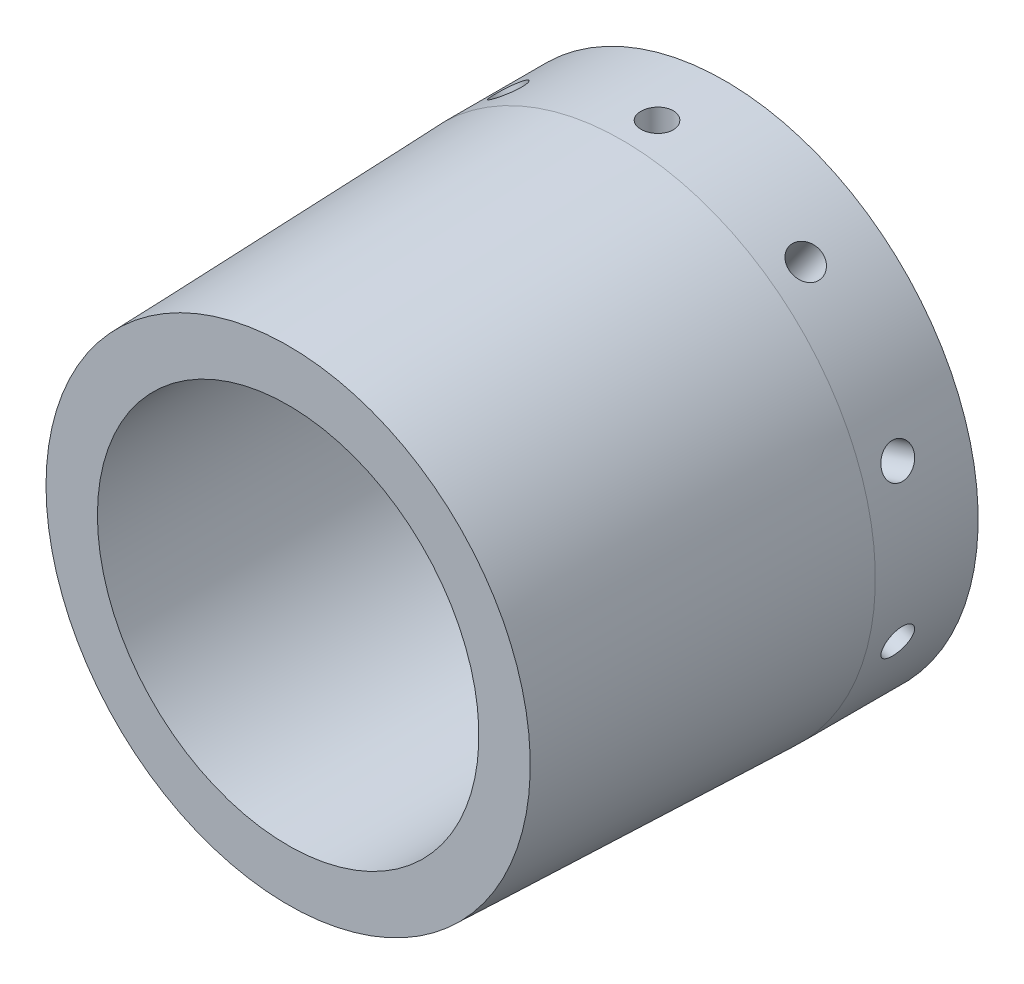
from build123d import *

# Parameters (mm, degrees)
CUT_EXTRUDE2_REACH      = 121.986
CUT_EXTRUDE2_END_RADIUS = 28.5115
SKETCH3_R               = 2.413
CIRPATTERN3_COUNT       = 10


with BuildPart() as part:
    # Sketch2 → Revolve1 (revolve)
    with BuildSketch(Plane(origin=(0, 0, 0), x_dir=(1, 0, 0), z_dir=(0, 1, 0))):
        Polygon((0, 0), (-9.3345, 0), (-9.3345, -15.367), (-7.6835, -65.300225), (0, -65.300225), align=None)
    revolve(axis=Axis((28.5115, 0, 0), (0, 0, 1)))

    # Cut-Extrude2: up to this cylinder (the profile starts outside it)
    cut_extrude2_end = Plane(origin=(28.5115, 0, 10.16), z_dir=(0, 0, -1)) * Cylinder(CUT_EXTRUDE2_END_RADIUS, 301.995, mode=Mode.PRIVATE)
    # Sketch3 → Cut-Extrude2 (cut, up to the surface)
    with BuildSketch(Plane(origin=(0, 37.846, 0), x_dir=(1, 0, 0), z_dir=(0, 1, 0)), mode=Mode.PRIVATE) as cut_extrude2_sk1:
        with Locations(Location((28.5115, -10.16, 0), (0, 0, 270))):
            Circle(SKETCH3_R)
    cut_extrude2_tool1 = extrude(cut_extrude2_sk1.sketch, amount=-CUT_EXTRUDE2_REACH, mode=Mode.PRIVATE) - cut_extrude2_end
    cut_extrude2 = cut_extrude2_tool1.solids().sort_by_distance((28.5115, 37.846, 10.16))[0]
    add(cut_extrude2, mode=Mode.SUBTRACT)

    # CirPattern3: Cut-Extrude2 ×10 about axis
    cirpattern3_axis = Axis((28.5115, 0, 0), (0, 0, -1))
    for i in range(1, CIRPATTERN3_COUNT):
        add(cut_extrude2.rotate(cirpattern3_axis, i * 360 / CIRPATTERN3_COUNT), mode=Mode.SUBTRACT)


solid = part.part
